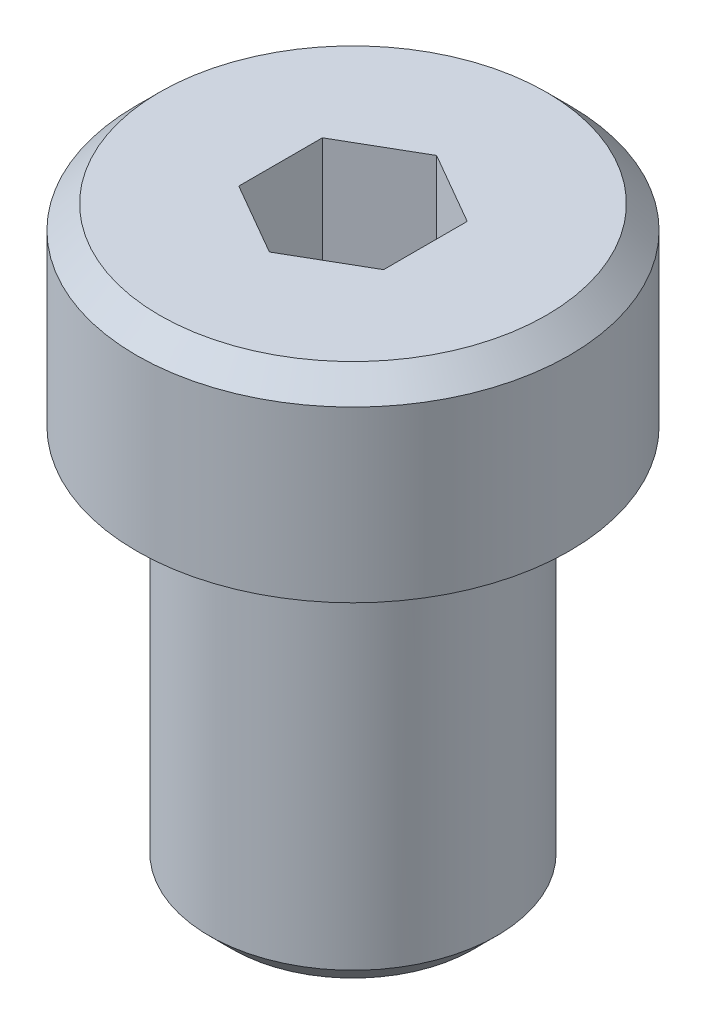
ISO-10303-21;
HEADER;
FILE_DESCRIPTION(('STEP AP214'),'2;1');
FILE_NAME('part.step','',(''),(''),'','','');
FILE_SCHEMA(('AUTOMOTIVE_DESIGN { 1 0 10303 214 1 1 1 1 }'));
ENDSEC;
DATA;
#1=APPLICATION_CONTEXT('core data for automotive mechanical design processes');
#2=APPLICATION_PROTOCOL_DEFINITION('international standard','automotive_design',2000,#1);
#3=PRODUCT_CONTEXT('',#1,'mechanical');
#4=PRODUCT('Part','Part','',(#3));
#5=PRODUCT_RELATED_PRODUCT_CATEGORY('part','',(#4));
#6=PRODUCT_DEFINITION_FORMATION('','',#4);
#7=PRODUCT_DEFINITION_CONTEXT('part definition',#1,'design');
#8=PRODUCT_DEFINITION('design','',#6,#7);
#9=PRODUCT_DEFINITION_SHAPE('','',#8);
#10=(LENGTH_UNIT() NAMED_UNIT(*) SI_UNIT(.MILLI.,.METRE.));
#11=(NAMED_UNIT(*) PLANE_ANGLE_UNIT() SI_UNIT($,.RADIAN.));
#12=(NAMED_UNIT(*) SI_UNIT($,.STERADIAN.) SOLID_ANGLE_UNIT());
#13=UNCERTAINTY_MEASURE_WITH_UNIT(LENGTH_MEASURE(1.E-05),#10,'distance_accuracy_value','');
#14=(GEOMETRIC_REPRESENTATION_CONTEXT(3) GLOBAL_UNCERTAINTY_ASSIGNED_CONTEXT((#13)) GLOBAL_UNIT_ASSIGNED_CONTEXT((#10,
#11,#12)) REPRESENTATION_CONTEXT('',''));
#15=CARTESIAN_POINT('',(0.,0.,0.));
#16=DIRECTION('',(0.,0.,1.));
#17=DIRECTION('',(1.,0.,0.));
#18=AXIS2_PLACEMENT_3D('',#15,#16,#17);
#19=CARTESIAN_POINT('',(0.,0.,0.));
#20=DIRECTION('',(0.,-1.,0.));
#21=DIRECTION('',(1.,0.,0.));
#22=AXIS2_PLACEMENT_3D('',#19,#20,#21);
#23=PLANE('',#22);
#24=CARTESIAN_POINT('',(0.,0.,0.));
#25=DIRECTION('',(0.,-1.,0.));
#26=DIRECTION('',(1.,0.,0.));
#27=AXIS2_PLACEMENT_3D('',#24,#25,#26);
#28=CIRCLE('',#27,4.7371);
#29=CARTESIAN_POINT('',(4.7371,0.,0.));
#30=VERTEX_POINT('',#29);
#31=EDGE_CURVE('E146',#30,#30,#28,.T.);
#32=ORIENTED_EDGE('',*,*,#31,.F.);
#33=EDGE_LOOP('',(#32));
#34=FACE_BOUND('',#33,.T.);
#35=CARTESIAN_POINT('',(0.,0.,0.));
#36=DIRECTION('',(0.,-1.,0.));
#37=DIRECTION('',(1.,0.,0.));
#38=AXIS2_PLACEMENT_3D('',#35,#36,#37);
#39=CIRCLE('',#38,7.137393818);
#40=CARTESIAN_POINT('',(7.137393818,0.,0.));
#41=VERTEX_POINT('',#40);
#42=EDGE_CURVE('E143',#41,#41,#39,.T.);
#43=ORIENTED_EDGE('',*,*,#42,.T.);
#44=EDGE_LOOP('',(#43));
#45=FACE_BOUND('',#44,.T.);
#46=ADVANCED_FACE('F30',(#34,#45),#23,.T.);
#47=CARTESIAN_POINT('',(0.,0.,0.));
#48=DIRECTION('',(0.,-1.,0.));
#49=DIRECTION('',(1.,0.,0.));
#50=AXIS2_PLACEMENT_3D('',#47,#48,#49);
#51=CYLINDRICAL_SURFACE('',#50,7.137393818);
#52=CARTESIAN_POINT('',(0.,5.5879945,0.));
#53=DIRECTION('',(0.,-1.,0.));
#54=DIRECTION('',(1.,0.,0.));
#55=AXIS2_PLACEMENT_3D('',#52,#53,#54);
#56=CIRCLE('',#55,7.137393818);
#57=CARTESIAN_POINT('',(7.137393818,5.5879945,0.));
#58=VERTEX_POINT('',#57);
#59=EDGE_CURVE('E140',#58,#58,#56,.T.);
#60=ORIENTED_EDGE('',*,*,#59,.T.);
#61=EDGE_LOOP('',(#60));
#62=FACE_BOUND('',#61,.T.);
#63=ORIENTED_EDGE('',*,*,#42,.F.);
#64=EDGE_LOOP('',(#63));
#65=FACE_BOUND('',#64,.T.);
#66=ADVANCED_FACE('F162',(#62,#65),#51,.T.);
#67=CARTESIAN_POINT('',(0.,5.5879945,0.));
#68=DIRECTION('',(0.,-1.,0.));
#69=DIRECTION('',(1.,0.,0.));
#70=AXIS2_PLACEMENT_3D('',#67,#68,#69);
#71=CONICAL_SURFACE('',#70,7.137393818,0.785398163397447);
#72=CARTESIAN_POINT('',(0.,6.3499945,0.));
#73=DIRECTION('',(0.,-1.,0.));
#74=DIRECTION('',(1.,0.,0.));
#75=AXIS2_PLACEMENT_3D('',#72,#73,#74);
#76=CIRCLE('',#75,6.375393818);
#77=CARTESIAN_POINT('',(6.375393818,6.3499945,0.));
#78=VERTEX_POINT('',#77);
#79=EDGE_CURVE('E132',#78,#78,#76,.T.);
#80=ORIENTED_EDGE('',*,*,#79,.T.);
#81=EDGE_LOOP('',(#80));
#82=FACE_BOUND('',#81,.T.);
#83=ORIENTED_EDGE('',*,*,#59,.F.);
#84=EDGE_LOOP('',(#83));
#85=FACE_BOUND('',#84,.T.);
#86=ADVANCED_FACE('F167',(#82,#85),#71,.T.);
#87=CARTESIAN_POINT('',(6.375393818,6.3499945,0.));
#88=DIRECTION('',(0.,1.,0.));
#89=DIRECTION('',(-1.,0.,0.));
#90=AXIS2_PLACEMENT_3D('',#87,#88,#89);
#91=PLANE('',#90);
#92=DIRECTION('',(-4.53589793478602E-07,0.,0.999999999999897));
#93=VECTOR('',#92,1.);
#94=CARTESIAN_POINT('',(-2.38759668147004,6.3499945,-1.37848223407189));
#95=LINE('',#94,#93);
#96=CARTESIAN_POINT('',(-2.38759668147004,6.3499945,-1.37848223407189));
#97=VERTEX_POINT('',#96);
#98=CARTESIAN_POINT('',(-2.387597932,6.3499945,1.37848006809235));
#99=VERTEX_POINT('',#98);
#100=EDGE_CURVE('E45',#97,#99,#95,.T.);
#101=ORIENTED_EDGE('',*,*,#100,.F.);
#102=DIRECTION('',(-0.866025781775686,0.,0.499999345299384));
#103=VECTOR('',#102,1.);
#104=CARTESIAN_POINT('',(1.87579371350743E-06,6.3499945,-2.75696049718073));
#105=LINE('',#104,#103);
#106=CARTESIAN_POINT('',(1.87579371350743E-06,6.3499945,-2.75696049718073));
#107=VERTEX_POINT('',#106);
#108=EDGE_CURVE('E128',#107,#97,#105,.T.);
#109=ORIENTED_EDGE('',*,*,#108,.F.);
#110=DIRECTION('',(-0.866025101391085,0.,-0.500000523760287));
#111=VECTOR('',#110,1.);
#112=CARTESIAN_POINT('',(2.38759855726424,6.3499945,-1.37847898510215));
#113=LINE('',#112,#111);
#114=CARTESIAN_POINT('',(2.38759855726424,6.3499945,-1.37847898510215));
#115=VERTEX_POINT('',#114);
#116=EDGE_CURVE('E126',#115,#107,#113,.T.);
#117=ORIENTED_EDGE('',*,*,#116,.F.);
#118=DIRECTION('',(4.53589793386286E-07,0.,-0.999999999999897));
#119=VECTOR('',#118,1.);
#120=CARTESIAN_POINT('',(2.38759730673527,6.3499945,1.37848115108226));
#121=LINE('',#120,#119);
#122=CARTESIAN_POINT('',(2.38759730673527,6.3499945,1.37848115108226));
#123=VERTEX_POINT('',#122);
#124=EDGE_CURVE('E93',#123,#115,#121,.T.);
#125=ORIENTED_EDGE('',*,*,#124,.F.);
#126=DIRECTION('',(0.866025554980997,0.,-0.499999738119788));
#127=VECTOR('',#126,1.);
#128=CARTESIAN_POINT('',(-6.25264571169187E-07,6.3499945,2.7569604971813));
#129=LINE('',#128,#127);
#130=CARTESIAN_POINT('',(-6.25264571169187E-07,6.3499945,2.7569604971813));
#131=VERTEX_POINT('',#130);
#132=EDGE_CURVE('E122',#131,#123,#129,.T.);
#133=ORIENTED_EDGE('',*,*,#132,.F.);
#134=DIRECTION('',(0.86602532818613,0.,0.500000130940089));
#135=VECTOR('',#134,1.);
#136=CARTESIAN_POINT('',(-2.387597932,6.3499945,1.37848006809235));
#137=LINE('',#136,#135);
#138=EDGE_CURVE('E119',#99,#131,#137,.T.);
#139=ORIENTED_EDGE('',*,*,#138,.F.);
#140=EDGE_LOOP('',(#101,#109,#117,#125,#133,#139));
#141=FACE_BOUND('',#140,.T.);
#142=ORIENTED_EDGE('',*,*,#79,.F.);
#143=EDGE_LOOP('',(#142));
#144=FACE_BOUND('',#143,.T.);
#145=ADVANCED_FACE('F175',(#141,#144),#91,.T.);
#146=CARTESIAN_POINT('',(0.,-12.954,0.));
#147=DIRECTION('',(0.,-1.,0.));
#148=DIRECTION('',(0.,0.,-1.));
#149=AXIS2_PLACEMENT_3D('',#146,#147,#148);
#150=PLANE('',#149);
#151=CARTESIAN_POINT('',(0.,-12.954,0.));
#152=DIRECTION('',(0.,-1.,0.));
#153=DIRECTION('',(0.,0.,-1.));
#154=AXIS2_PLACEMENT_3D('',#151,#152,#153);
#155=CIRCLE('',#154,3.9751);
#156=CARTESIAN_POINT('',(0.,-12.954,-3.9751));
#157=VERTEX_POINT('',#156);
#158=EDGE_CURVE('E38',#157,#157,#155,.T.);
#159=ORIENTED_EDGE('',*,*,#158,.T.);
#160=EDGE_LOOP('',(#159));
#161=FACE_BOUND('',#160,.T.);
#162=ADVANCED_FACE('F151',(#161),#150,.T.);
#163=CARTESIAN_POINT('',(0.,0.,0.));
#164=DIRECTION('',(0.,-1.,0.));
#165=DIRECTION('',(0.,0.,-1.));
#166=AXIS2_PLACEMENT_3D('',#163,#164,#165);
#167=CYLINDRICAL_SURFACE('',#166,4.7371);
#168=CARTESIAN_POINT('',(0.,-12.192,0.));
#169=DIRECTION('',(0.,-1.,0.));
#170=DIRECTION('',(0.,0.,-1.));
#171=AXIS2_PLACEMENT_3D('',#168,#169,#170);
#172=CIRCLE('',#171,4.7371);
#173=CARTESIAN_POINT('',(0.,-12.192,-4.7371));
#174=VERTEX_POINT('',#173);
#175=EDGE_CURVE('E11',#174,#174,#172,.F.);
#176=ORIENTED_EDGE('',*,*,#175,.T.);
#177=EDGE_LOOP('',(#176));
#178=FACE_BOUND('',#177,.T.);
#179=ORIENTED_EDGE('',*,*,#31,.T.);
#180=EDGE_LOOP('',(#179));
#181=FACE_BOUND('',#180,.T.);
#182=ADVANCED_FACE('F182',(#178,#181),#167,.T.);
#183=CARTESIAN_POINT('',(-2.38759668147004,2.768597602,-1.37848223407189));
#184=DIRECTION('',(-0.999999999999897,0.,-4.53589793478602E-07));
#185=DIRECTION('',(-4.53589793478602E-07,0.,0.999999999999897));
#186=AXIS2_PLACEMENT_3D('',#183,#184,#185);
#187=PLANE('',#186);
#188=ORIENTED_EDGE('',*,*,#100,.T.);
#189=DIRECTION('',(0.,1.,0.));
#190=VECTOR('',#189,1.);
#191=CARTESIAN_POINT('',(-2.387597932,2.768597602,1.37848006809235));
#192=LINE('',#191,#190);
#193=CARTESIAN_POINT('',(-2.387597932,2.768597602,1.37848006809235));
#194=VERTEX_POINT('',#193);
#195=EDGE_CURVE('E75',#194,#99,#192,.T.);
#196=ORIENTED_EDGE('',*,*,#195,.F.);
#197=DIRECTION('',(-4.53589793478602E-07,0.,0.999999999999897));
#198=VECTOR('',#197,1.);
#199=CARTESIAN_POINT('',(-2.38759668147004,2.768597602,-1.37848223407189));
#200=LINE('',#199,#198);
#201=CARTESIAN_POINT('',(-2.38759668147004,2.768597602,-1.37848223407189));
#202=VERTEX_POINT('',#201);
#203=EDGE_CURVE('E130',#202,#194,#200,.T.);
#204=ORIENTED_EDGE('',*,*,#203,.F.);
#205=DIRECTION('',(0.,1.,0.));
#206=VECTOR('',#205,1.);
#207=CARTESIAN_POINT('',(-2.38759668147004,2.768597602,-1.37848223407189));
#208=LINE('',#207,#206);
#209=EDGE_CURVE('E53',#202,#97,#208,.T.);
#210=ORIENTED_EDGE('',*,*,#209,.T.);
#211=EDGE_LOOP('',(#188,#196,#204,#210));
#212=FACE_BOUND('',#211,.T.);
#213=ADVANCED_FACE('F185',(#212),#187,.F.);
#214=CARTESIAN_POINT('',(1.87579371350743E-06,2.768597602,-2.75696049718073));
#215=DIRECTION('',(-0.499999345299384,0.,-0.866025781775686));
#216=DIRECTION('',(-0.866025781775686,0.,0.499999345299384));
#217=AXIS2_PLACEMENT_3D('',#214,#215,#216);
#218=PLANE('',#217);
#219=ORIENTED_EDGE('',*,*,#108,.T.);
#220=ORIENTED_EDGE('',*,*,#209,.F.);
#221=DIRECTION('',(-0.866025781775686,0.,0.499999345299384));
#222=VECTOR('',#221,1.);
#223=CARTESIAN_POINT('',(1.87579371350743E-06,2.768597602,-2.75696049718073));
#224=LINE('',#223,#222);
#225=CARTESIAN_POINT('',(1.87579371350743E-06,2.768597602,-2.75696049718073));
#226=VERTEX_POINT('',#225);
#227=EDGE_CURVE('E105',#226,#202,#224,.T.);
#228=ORIENTED_EDGE('',*,*,#227,.F.);
#229=DIRECTION('',(0.,1.,0.));
#230=VECTOR('',#229,1.);
#231=CARTESIAN_POINT('',(1.87579371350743E-06,2.768597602,-2.75696049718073));
#232=LINE('',#231,#230);
#233=EDGE_CURVE('E97',#226,#107,#232,.T.);
#234=ORIENTED_EDGE('',*,*,#233,.T.);
#235=EDGE_LOOP('',(#219,#220,#228,#234));
#236=FACE_BOUND('',#235,.T.);
#237=ADVANCED_FACE('F189',(#236),#218,.F.);
#238=CARTESIAN_POINT('',(2.38759855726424,2.768597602,-1.37847898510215));
#239=DIRECTION('',(0.500000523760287,0.,-0.866025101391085));
#240=DIRECTION('',(-0.866025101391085,0.,-0.500000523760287));
#241=AXIS2_PLACEMENT_3D('',#238,#239,#240);
#242=PLANE('',#241);
#243=ORIENTED_EDGE('',*,*,#116,.T.);
#244=ORIENTED_EDGE('',*,*,#233,.F.);
#245=DIRECTION('',(-0.866025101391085,0.,-0.500000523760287));
#246=VECTOR('',#245,1.);
#247=CARTESIAN_POINT('',(2.38759855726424,2.768597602,-1.37847898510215));
#248=LINE('',#247,#246);
#249=CARTESIAN_POINT('',(2.38759855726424,2.768597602,-1.37847898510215));
#250=VERTEX_POINT('',#249);
#251=EDGE_CURVE('E101',#250,#226,#248,.T.);
#252=ORIENTED_EDGE('',*,*,#251,.F.);
#253=DIRECTION('',(0.,1.,0.));
#254=VECTOR('',#253,1.);
#255=CARTESIAN_POINT('',(2.38759855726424,2.768597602,-1.37847898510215));
#256=LINE('',#255,#254);
#257=EDGE_CURVE('E86',#250,#115,#256,.T.);
#258=ORIENTED_EDGE('',*,*,#257,.T.);
#259=EDGE_LOOP('',(#243,#244,#252,#258));
#260=FACE_BOUND('',#259,.T.);
#261=ADVANCED_FACE('F102',(#260),#242,.F.);
#262=CARTESIAN_POINT('',(2.38759730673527,2.768597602,1.37848115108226));
#263=DIRECTION('',(0.999999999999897,0.,4.53589793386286E-07));
#264=DIRECTION('',(4.53589793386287E-07,0.,-0.999999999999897));
#265=AXIS2_PLACEMENT_3D('',#262,#263,#264);
#266=PLANE('',#265);
#267=ORIENTED_EDGE('',*,*,#124,.T.);
#268=ORIENTED_EDGE('',*,*,#257,.F.);
#269=DIRECTION('',(4.53589793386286E-07,0.,-0.999999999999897));
#270=VECTOR('',#269,1.);
#271=CARTESIAN_POINT('',(2.38759730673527,2.768597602,1.37848115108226));
#272=LINE('',#271,#270);
#273=CARTESIAN_POINT('',(2.38759730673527,2.768597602,1.37848115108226));
#274=VERTEX_POINT('',#273);
#275=EDGE_CURVE('E90',#274,#250,#272,.T.);
#276=ORIENTED_EDGE('',*,*,#275,.F.);
#277=DIRECTION('',(0.,1.,0.));
#278=VECTOR('',#277,1.);
#279=CARTESIAN_POINT('',(2.38759730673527,2.768597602,1.37848115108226));
#280=LINE('',#279,#278);
#281=EDGE_CURVE('E98',#274,#123,#280,.T.);
#282=ORIENTED_EDGE('',*,*,#281,.T.);
#283=EDGE_LOOP('',(#267,#268,#276,#282));
#284=FACE_BOUND('',#283,.T.);
#285=ADVANCED_FACE('F88',(#284),#266,.F.);
#286=CARTESIAN_POINT('',(-6.25264571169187E-07,2.768597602,2.7569604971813));
#287=DIRECTION('',(0.499999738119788,0.,0.866025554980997));
#288=DIRECTION('',(0.866025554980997,0.,-0.499999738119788));
#289=AXIS2_PLACEMENT_3D('',#286,#287,#288);
#290=PLANE('',#289);
#291=ORIENTED_EDGE('',*,*,#132,.T.);
#292=ORIENTED_EDGE('',*,*,#281,.F.);
#293=DIRECTION('',(0.866025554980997,0.,-0.499999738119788));
#294=VECTOR('',#293,1.);
#295=CARTESIAN_POINT('',(-6.25264571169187E-07,2.768597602,2.7569604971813));
#296=LINE('',#295,#294);
#297=CARTESIAN_POINT('',(-6.25264571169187E-07,2.768597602,2.7569604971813));
#298=VERTEX_POINT('',#297);
#299=EDGE_CURVE('E111',#298,#274,#296,.T.);
#300=ORIENTED_EDGE('',*,*,#299,.F.);
#301=DIRECTION('',(0.,1.,0.));
#302=VECTOR('',#301,1.);
#303=CARTESIAN_POINT('',(-6.25264571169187E-07,2.768597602,2.7569604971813));
#304=LINE('',#303,#302);
#305=EDGE_CURVE('E135',#298,#131,#304,.T.);
#306=ORIENTED_EDGE('',*,*,#305,.T.);
#307=EDGE_LOOP('',(#291,#292,#300,#306));
#308=FACE_BOUND('',#307,.T.);
#309=ADVANCED_FACE('F192',(#308),#290,.F.);
#310=CARTESIAN_POINT('',(-2.387597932,2.768597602,1.37848006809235));
#311=DIRECTION('',(-0.500000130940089,0.,0.86602532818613));
#312=DIRECTION('',(0.86602532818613,0.,0.500000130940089));
#313=AXIS2_PLACEMENT_3D('',#310,#311,#312);
#314=PLANE('',#313);
#315=ORIENTED_EDGE('',*,*,#138,.T.);
#316=ORIENTED_EDGE('',*,*,#305,.F.);
#317=DIRECTION('',(0.86602532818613,0.,0.500000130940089));
#318=VECTOR('',#317,1.);
#319=CARTESIAN_POINT('',(-2.387597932,2.768597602,1.37848006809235));
#320=LINE('',#319,#318);
#321=EDGE_CURVE('E113',#194,#298,#320,.T.);
#322=ORIENTED_EDGE('',*,*,#321,.F.);
#323=ORIENTED_EDGE('',*,*,#195,.T.);
#324=EDGE_LOOP('',(#315,#316,#322,#323));
#325=FACE_BOUND('',#324,.T.);
#326=ADVANCED_FACE('F158',(#325),#314,.F.);
#327=CARTESIAN_POINT('',(-2.387597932,2.768597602,1.37848006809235));
#328=DIRECTION('',(0.,1.,0.));
#329=DIRECTION('',(0.,0.,1.));
#330=AXIS2_PLACEMENT_3D('',#327,#328,#329);
#331=PLANE('',#330);
#332=ORIENTED_EDGE('',*,*,#203,.T.);
#333=ORIENTED_EDGE('',*,*,#321,.T.);
#334=ORIENTED_EDGE('',*,*,#299,.T.);
#335=ORIENTED_EDGE('',*,*,#275,.T.);
#336=ORIENTED_EDGE('',*,*,#251,.T.);
#337=ORIENTED_EDGE('',*,*,#227,.T.);
#338=EDGE_LOOP('',(#332,#333,#334,#335,#336,#337));
#339=FACE_BOUND('',#338,.T.);
#340=ADVANCED_FACE('F108',(#339),#331,.T.);
#341=CARTESIAN_POINT('',(0.,-12.954,0.));
#342=DIRECTION('',(0.,1.,0.));
#343=DIRECTION('',(0.,0.,1.));
#344=AXIS2_PLACEMENT_3D('',#341,#342,#343);
#345=CONICAL_SURFACE('',#344,3.9751,0.785398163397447);
#346=ORIENTED_EDGE('',*,*,#175,.F.);
#347=EDGE_LOOP('',(#346));
#348=FACE_BOUND('',#347,.T.);
#349=ORIENTED_EDGE('',*,*,#158,.F.);
#350=EDGE_LOOP('',(#349));
#351=FACE_BOUND('',#350,.T.);
#352=ADVANCED_FACE('F32',(#348,#351),#345,.T.);
#353=CLOSED_SHELL('',(#46,#66,#86,#145,#162,#182,#213,#237,#261,#285,#309,#326,#340,#352));
#354=MANIFOLD_SOLID_BREP('B2',#353);
#355=ADVANCED_BREP_SHAPE_REPRESENTATION('',(#18,#354),#14);
#356=SHAPE_DEFINITION_REPRESENTATION(#9,#355);
ENDSEC;
END-ISO-10303-21;
